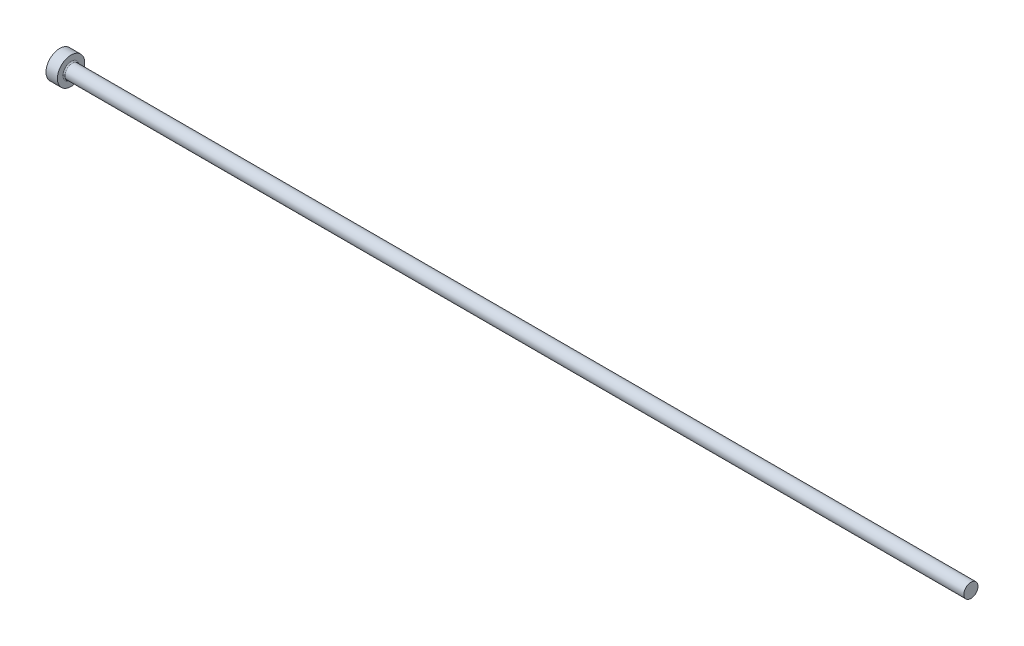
ISO-10303-21;
HEADER;
FILE_DESCRIPTION(('STEP AP214'),'2;1');
FILE_NAME('part.step','',(''),(''),'','','');
FILE_SCHEMA(('AUTOMOTIVE_DESIGN { 1 0 10303 214 1 1 1 1 }'));
ENDSEC;
DATA;
#1=APPLICATION_CONTEXT('core data for automotive mechanical design processes');
#2=APPLICATION_PROTOCOL_DEFINITION('international standard','automotive_design',2000,#1);
#3=PRODUCT_CONTEXT('',#1,'mechanical');
#4=PRODUCT('Part','Part','',(#3));
#5=PRODUCT_RELATED_PRODUCT_CATEGORY('part','',(#4));
#6=PRODUCT_DEFINITION_FORMATION('','',#4);
#7=PRODUCT_DEFINITION_CONTEXT('part definition',#1,'design');
#8=PRODUCT_DEFINITION('design','',#6,#7);
#9=PRODUCT_DEFINITION_SHAPE('','',#8);
#10=(LENGTH_UNIT() NAMED_UNIT(*) SI_UNIT(.MILLI.,.METRE.));
#11=(NAMED_UNIT(*) PLANE_ANGLE_UNIT() SI_UNIT($,.RADIAN.));
#12=(NAMED_UNIT(*) SI_UNIT($,.STERADIAN.) SOLID_ANGLE_UNIT());
#13=UNCERTAINTY_MEASURE_WITH_UNIT(LENGTH_MEASURE(1.E-05),#10,'distance_accuracy_value','');
#14=(GEOMETRIC_REPRESENTATION_CONTEXT(3) GLOBAL_UNCERTAINTY_ASSIGNED_CONTEXT((#13)) GLOBAL_UNIT_ASSIGNED_CONTEXT((#10,
#11,#12)) REPRESENTATION_CONTEXT('',''));
#15=CARTESIAN_POINT('',(0.,0.,0.));
#16=DIRECTION('',(0.,0.,1.));
#17=DIRECTION('',(1.,0.,0.));
#18=AXIS2_PLACEMENT_3D('',#15,#16,#17);
#19=CARTESIAN_POINT('',(0.,0.,0.));
#20=DIRECTION('',(-1.,0.,0.));
#21=DIRECTION('',(0.,-1.,0.));
#22=AXIS2_PLACEMENT_3D('',#19,#20,#21);
#23=PLANE('',#22);
#24=CARTESIAN_POINT('',(0.,0.,0.));
#25=DIRECTION('',(1.,0.,0.));
#26=DIRECTION('',(0.,1.,0.));
#27=AXIS2_PLACEMENT_3D('',#24,#25,#26);
#28=CIRCLE('',#27,6.);
#29=CARTESIAN_POINT('',(0.,6.,0.));
#30=VERTEX_POINT('',#29);
#31=EDGE_CURVE('E25',#30,#30,#28,.T.);
#32=ORIENTED_EDGE('',*,*,#31,.F.);
#33=EDGE_LOOP('',(#32));
#34=FACE_BOUND('',#33,.T.);
#35=ADVANCED_FACE('F14',(#34),#23,.T.);
#36=CARTESIAN_POINT('',(400.,0.,0.));
#37=DIRECTION('',(1.,0.,0.));
#38=DIRECTION('',(0.,1.,0.));
#39=AXIS2_PLACEMENT_3D('',#36,#37,#38);
#40=CYLINDRICAL_SURFACE('',#39,6.);
#41=ORIENTED_EDGE('',*,*,#31,.T.);
#42=EDGE_LOOP('',(#41));
#43=FACE_BOUND('',#42,.T.);
#44=CARTESIAN_POINT('',(5.,0.,0.));
#45=DIRECTION('',(1.,0.,0.));
#46=DIRECTION('',(0.,1.,0.));
#47=AXIS2_PLACEMENT_3D('',#44,#45,#46);
#48=CIRCLE('',#47,6.);
#49=CARTESIAN_POINT('',(5.,6.,0.));
#50=VERTEX_POINT('',#49);
#51=EDGE_CURVE('E29',#50,#50,#48,.T.);
#52=ORIENTED_EDGE('',*,*,#51,.F.);
#53=EDGE_LOOP('',(#52));
#54=FACE_BOUND('',#53,.T.);
#55=ADVANCED_FACE('F51',(#43,#54),#40,.T.);
#56=CARTESIAN_POINT('',(5.,6.,0.));
#57=DIRECTION('',(1.,0.,0.));
#58=DIRECTION('',(0.,1.,0.));
#59=AXIS2_PLACEMENT_3D('',#56,#57,#58);
#60=PLANE('',#59);
#61=CARTESIAN_POINT('',(5.,0.,0.));
#62=DIRECTION('',(1.,0.,0.));
#63=DIRECTION('',(0.,1.,0.));
#64=AXIS2_PLACEMENT_3D('',#61,#62,#63);
#65=CIRCLE('',#64,3.59999999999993);
#66=CARTESIAN_POINT('',(5.,3.59999999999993,0.));
#67=VERTEX_POINT('',#66);
#68=EDGE_CURVE('E9',#67,#67,#65,.F.);
#69=ORIENTED_EDGE('',*,*,#68,.T.);
#70=EDGE_LOOP('',(#69));
#71=FACE_BOUND('',#70,.T.);
#72=ORIENTED_EDGE('',*,*,#51,.T.);
#73=EDGE_LOOP('',(#72));
#74=FACE_BOUND('',#73,.T.);
#75=ADVANCED_FACE('F42',(#71,#74),#60,.T.);
#76=CARTESIAN_POINT('',(400.,0.,0.));
#77=DIRECTION('',(1.,0.,0.));
#78=DIRECTION('',(0.,1.,0.));
#79=AXIS2_PLACEMENT_3D('',#76,#77,#78);
#80=CYLINDRICAL_SURFACE('',#79,3.09999999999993);
#81=CARTESIAN_POINT('',(5.5,0.,0.));
#82=DIRECTION('',(1.,0.,0.));
#83=DIRECTION('',(0.,1.,0.));
#84=AXIS2_PLACEMENT_3D('',#81,#82,#83);
#85=CIRCLE('',#84,3.09999999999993);
#86=CARTESIAN_POINT('',(5.5,3.09999999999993,0.));
#87=VERTEX_POINT('',#86);
#88=EDGE_CURVE('E21',#87,#87,#85,.T.);
#89=ORIENTED_EDGE('',*,*,#88,.T.);
#90=EDGE_LOOP('',(#89));
#91=FACE_BOUND('',#90,.T.);
#92=CARTESIAN_POINT('',(400.,0.,0.));
#93=DIRECTION('',(1.,0.,0.));
#94=DIRECTION('',(0.,1.,0.));
#95=AXIS2_PLACEMENT_3D('',#92,#93,#94);
#96=CIRCLE('',#95,3.09999999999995);
#97=CARTESIAN_POINT('',(400.,3.09999999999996,0.));
#98=VERTEX_POINT('',#97);
#99=EDGE_CURVE('E34',#98,#98,#96,.T.);
#100=ORIENTED_EDGE('',*,*,#99,.F.);
#101=EDGE_LOOP('',(#100));
#102=FACE_BOUND('',#101,.T.);
#103=ADVANCED_FACE('F40',(#91,#102),#80,.T.);
#104=CARTESIAN_POINT('',(400.,3.09999999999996,0.));
#105=DIRECTION('',(1.,0.,0.));
#106=DIRECTION('',(0.,1.,0.));
#107=AXIS2_PLACEMENT_3D('',#104,#105,#106);
#108=PLANE('',#107);
#109=ORIENTED_EDGE('',*,*,#99,.T.);
#110=EDGE_LOOP('',(#109));
#111=FACE_BOUND('',#110,.T.);
#112=ADVANCED_FACE('F38',(#111),#108,.T.);
#113=CARTESIAN_POINT('',(5.5,0.,0.));
#114=DIRECTION('',(1.,0.,0.));
#115=DIRECTION('',(0.,1.,0.));
#116=AXIS2_PLACEMENT_3D('',#113,#114,#115);
#117=TOROIDAL_SURFACE('',#116,3.59999999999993,0.5);
#118=ORIENTED_EDGE('',*,*,#68,.F.);
#119=EDGE_LOOP('',(#118));
#120=FACE_BOUND('',#119,.T.);
#121=ORIENTED_EDGE('',*,*,#88,.F.);
#122=EDGE_LOOP('',(#121));
#123=FACE_BOUND('',#122,.T.);
#124=ADVANCED_FACE('F16',(#120,#123),#117,.F.);
#125=CLOSED_SHELL('',(#35,#55,#75,#103,#112,#124));
#126=MANIFOLD_SOLID_BREP('B1',#125);
#127=ADVANCED_BREP_SHAPE_REPRESENTATION('',(#18,#126),#14);
#128=SHAPE_DEFINITION_REPRESENTATION(#9,#127);
ENDSEC;
END-ISO-10303-21;
